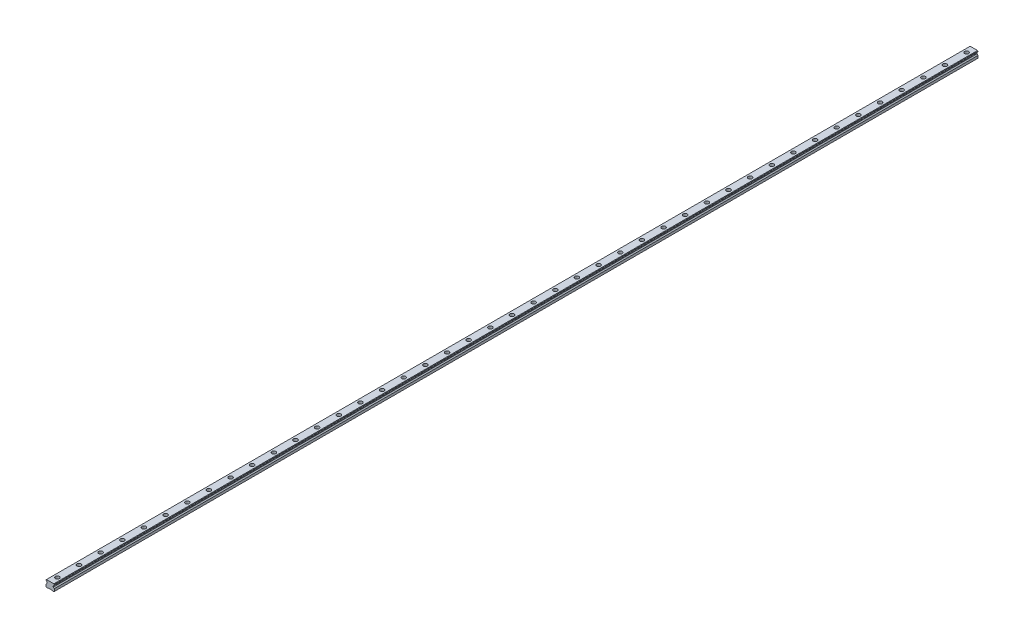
from build123d import *

# Parameters (mm, degrees)
SKETCH1_W           = 23
SKETCH1_H           = 19.2
BOSS_EXTRUDE1_DEPTH = 1280
CUT_EXTRUDE1_DEPTH  = 2561.097828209
CHAMFER1_SIZE       = 1.25
FILLET1_R           = 1.25
CUT_EXTRUDE2_DEPTH  = 2561.097828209
SKETCH4_R           = 5.5
SKETCH4_R_2         = 3.5
CUT_EXTRUDE3_DEPTH  = 9
SKETCH4_2_R         = 3.5
CUT_EXTRUDE4_DEPTH  = 1281.195645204
LPATTERN1_COUNT     = 43
LPATTERN1_PITCH     = 60


with BuildPart() as part:
    # Sketch1 → Boss-Extrude1 (new, symmetric)
    with BuildSketch(Plane.XY):
        with Locations((0, 9.6)):
            Rectangle(SKETCH1_W, SKETCH1_H)
    extrude(amount=BOSS_EXTRUDE1_DEPTH, both=True)

    # Sketch2 → Cut-Extrude1 (cut, through all)
    with BuildSketch(Plane.XY.offset(1280)):
        Polygon((-11.5, 16.7), (-11.5, 7.95), (-8.583333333, 10.866666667), (-8.583333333, 13.783333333), align=None)
        Polygon((8.583333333, 13.783333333), (11.5, 16.7), (11.5, 7.95), (8.583333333, 10.866666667), align=None)
    extrude(amount=-CUT_EXTRUDE1_DEPTH, mode=Mode.SUBTRACT)

    # Chamfer1
    chamfer1_edges = [part.edges().sort_by_distance(p)[0] for p in [
        (-11.5, 19.2, 0),
        (11.5, 19.2, 0),
        (11.5, 0, 0),
        (-11.5, 0, 0),
    ]]
    chamfer(chamfer1_edges, length=CHAMFER1_SIZE)

    # Fillet1
    fillet1_edges = [part.edges().sort_by_distance(p)[0] for p in [
        (-8.583333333, 13.783333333, 0),
        (-8.583333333, 10.866666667, 0),
        (8.583333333, 10.866666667, 0),
        (8.583333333, 13.783333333, 0),
    ]]
    fillet(fillet1_edges, radius=FILLET1_R)

    # Sketch3 → Cut-Extrude2 (cut, through all)
    with BuildSketch(Plane.XY.offset(1280)):
        Polygon((-7, 0), (-5.75, 1.25), (5.75, 1.25), (7, 0), align=None)
    extrude(amount=-CUT_EXTRUDE2_DEPTH, mode=Mode.SUBTRACT)

    # Sketch4 → Cut-Extrude3 (cut)
    with BuildSketch(Plane(origin=(0, 19.2, 0), x_dir=(1, 0, 0), z_dir=(0, 1, 0))):
        with Locations(Location((0, -1260, 0), (0, 0, 270))):
            Circle(SKETCH4_R)
        with Locations(Location((0, -1260, 0), (0, 0, 270))):
            Circle(SKETCH4_R_2, mode=Mode.SUBTRACT)
    cut_extrude3 = extrude(amount=-CUT_EXTRUDE3_DEPTH, mode=Mode.SUBTRACT)

    # Sketch4_2 → Cut-Extrude4 (cut, through all)
    with BuildSketch(Plane(origin=(0, 19.2, 0), x_dir=(1, 0, 0), z_dir=(0, 1, 0))):
        with Locations(Location((0, -1260, 0), (0, 0, 270))):
            Circle(SKETCH4_2_R)
    cut_extrude4 = extrude(amount=-CUT_EXTRUDE4_DEPTH, mode=Mode.SUBTRACT)

    # LPattern1: Cut-Extrude3, Cut-Extrude4 ×43
    with Locations(*[(0, 0, -i * LPATTERN1_PITCH) for i in range(1, LPATTERN1_COUNT)]):
        add(cut_extrude3, mode=Mode.SUBTRACT)
        add(cut_extrude4, mode=Mode.SUBTRACT)


solid = part.part
